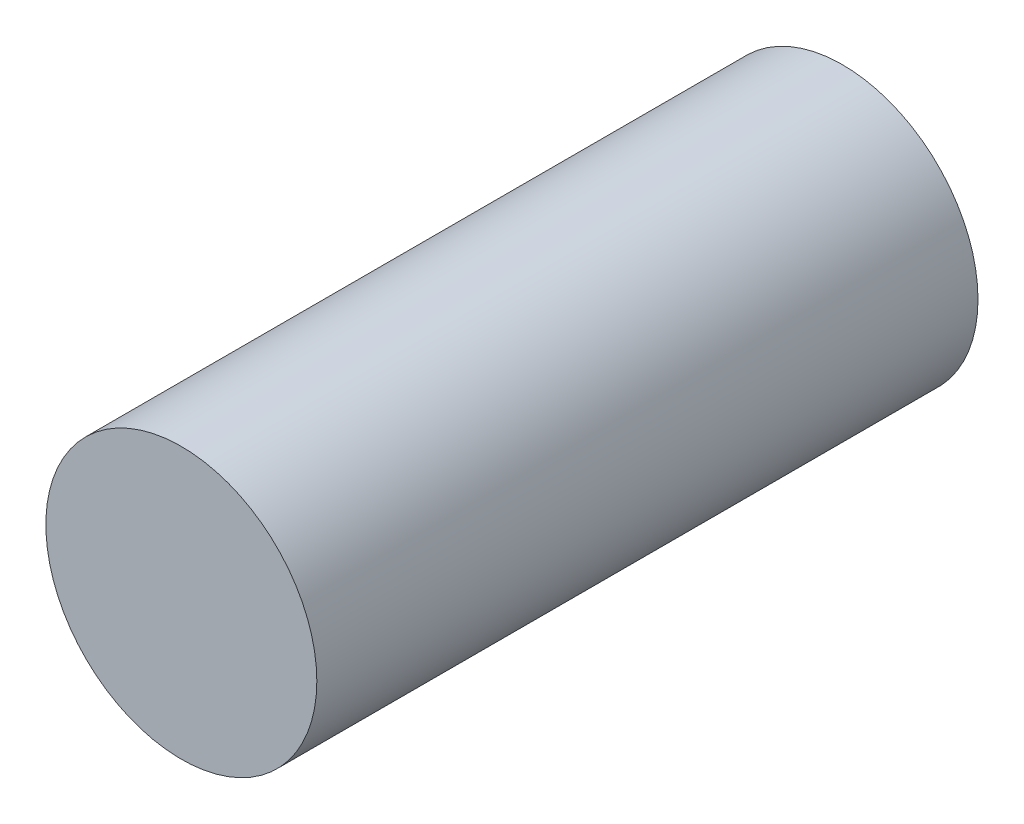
ISO-10303-21;
HEADER;
FILE_DESCRIPTION(('STEP AP214'),'2;1');
FILE_NAME('part.step','',(''),(''),'','','');
FILE_SCHEMA(('AUTOMOTIVE_DESIGN { 1 0 10303 214 1 1 1 1 }'));
ENDSEC;
DATA;
#1=APPLICATION_CONTEXT('core data for automotive mechanical design processes');
#2=APPLICATION_PROTOCOL_DEFINITION('international standard','automotive_design',2000,#1);
#3=PRODUCT_CONTEXT('',#1,'mechanical');
#4=PRODUCT('Part','Part','',(#3));
#5=PRODUCT_RELATED_PRODUCT_CATEGORY('part','',(#4));
#6=PRODUCT_DEFINITION_FORMATION('','',#4);
#7=PRODUCT_DEFINITION_CONTEXT('part definition',#1,'design');
#8=PRODUCT_DEFINITION('design','',#6,#7);
#9=PRODUCT_DEFINITION_SHAPE('','',#8);
#10=(LENGTH_UNIT() NAMED_UNIT(*) SI_UNIT(.MILLI.,.METRE.));
#11=(NAMED_UNIT(*) PLANE_ANGLE_UNIT() SI_UNIT($,.RADIAN.));
#12=(NAMED_UNIT(*) SI_UNIT($,.STERADIAN.) SOLID_ANGLE_UNIT());
#13=UNCERTAINTY_MEASURE_WITH_UNIT(LENGTH_MEASURE(1.E-05),#10,'distance_accuracy_value','');
#14=(GEOMETRIC_REPRESENTATION_CONTEXT(3) GLOBAL_UNCERTAINTY_ASSIGNED_CONTEXT((#13)) GLOBAL_UNIT_ASSIGNED_CONTEXT((#10,
#11,#12)) REPRESENTATION_CONTEXT('',''));
#15=CARTESIAN_POINT('',(0.,0.,0.));
#16=DIRECTION('',(0.,0.,1.));
#17=DIRECTION('',(1.,0.,0.));
#18=AXIS2_PLACEMENT_3D('',#15,#16,#17);
#19=CARTESIAN_POINT('',(0.,0.,10.329333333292));
#20=DIRECTION('',(0.,0.,1.));
#21=DIRECTION('',(1.,0.,0.));
#22=AXIS2_PLACEMENT_3D('',#19,#20,#21);
#23=PLANE('',#22);
#24=CARTESIAN_POINT('',(0.,0.,10.329333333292));
#25=DIRECTION('',(0.,0.,1.));
#26=DIRECTION('',(1.,0.,0.));
#27=AXIS2_PLACEMENT_3D('',#24,#25,#26);
#28=CIRCLE('',#27,2.1166666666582);
#29=CARTESIAN_POINT('',(2.1166666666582,0.,10.329333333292));
#30=VERTEX_POINT('',#29);
#31=EDGE_CURVE('E18',#30,#30,#28,.F.);
#32=ORIENTED_EDGE('',*,*,#31,.F.);
#33=EDGE_LOOP('',(#32));
#34=FACE_BOUND('',#33,.T.);
#35=ADVANCED_FACE('F15',(#34),#23,.T.);
#36=CARTESIAN_POINT('',(0.,0.,0.));
#37=DIRECTION('',(0.,0.,1.));
#38=DIRECTION('',(1.,0.,0.));
#39=AXIS2_PLACEMENT_3D('',#36,#37,#38);
#40=PLANE('',#39);
#41=CARTESIAN_POINT('',(0.,0.,0.));
#42=DIRECTION('',(0.,0.,1.));
#43=DIRECTION('',(1.,0.,0.));
#44=AXIS2_PLACEMENT_3D('',#41,#42,#43);
#45=CIRCLE('',#44,2.1166666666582);
#46=CARTESIAN_POINT('',(2.1166666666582,0.,0.));
#47=VERTEX_POINT('',#46);
#48=EDGE_CURVE('E10',#47,#47,#45,.T.);
#49=ORIENTED_EDGE('',*,*,#48,.F.);
#50=EDGE_LOOP('',(#49));
#51=FACE_BOUND('',#50,.T.);
#52=ADVANCED_FACE('F30',(#51),#40,.F.);
#53=CARTESIAN_POINT('',(0.,0.,0.));
#54=DIRECTION('',(0.,0.,1.));
#55=DIRECTION('',(1.,0.,0.));
#56=AXIS2_PLACEMENT_3D('',#53,#54,#55);
#57=CYLINDRICAL_SURFACE('',#56,2.1166666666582);
#58=ORIENTED_EDGE('',*,*,#31,.T.);
#59=EDGE_LOOP('',(#58));
#60=FACE_BOUND('',#59,.T.);
#61=ORIENTED_EDGE('',*,*,#48,.T.);
#62=EDGE_LOOP('',(#61));
#63=FACE_BOUND('',#62,.T.);
#64=ADVANCED_FACE('F27',(#60,#63),#57,.T.);
#65=CLOSED_SHELL('',(#35,#52,#64));
#66=MANIFOLD_SOLID_BREP('B1',#65);
#67=ADVANCED_BREP_SHAPE_REPRESENTATION('',(#18,#66),#14);
#68=SHAPE_DEFINITION_REPRESENTATION(#9,#67);
ENDSEC;
END-ISO-10303-21;
